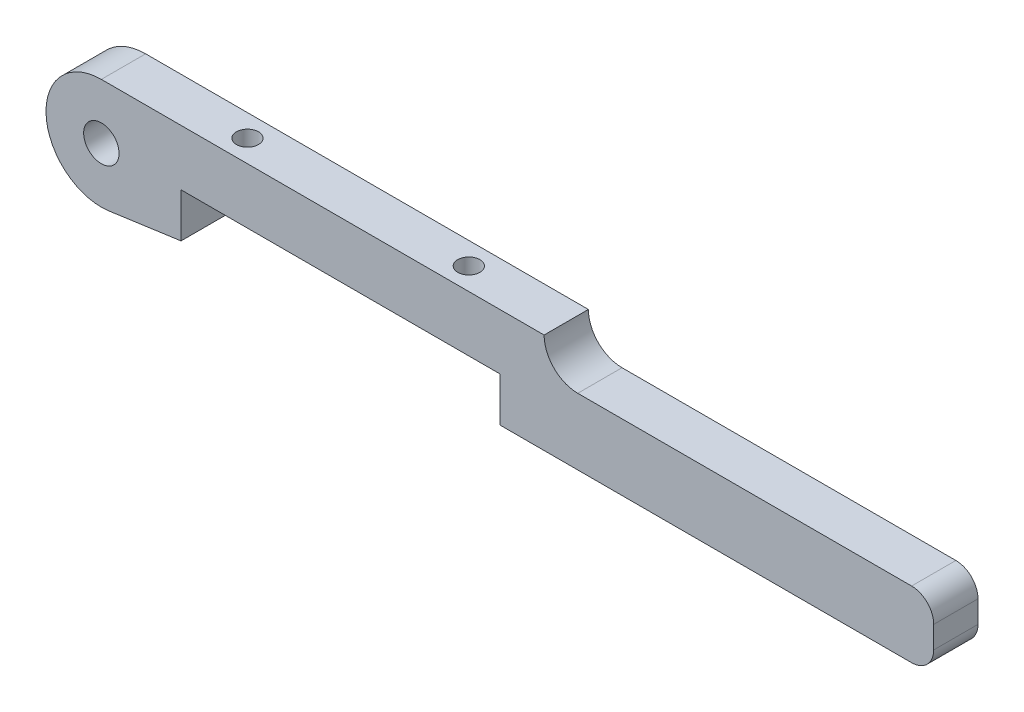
ISO-10303-21;
HEADER;
FILE_DESCRIPTION(('STEP AP214'),'2;1');
FILE_NAME('part.step','',(''),(''),'','','');
FILE_SCHEMA(('AUTOMOTIVE_DESIGN { 1 0 10303 214 1 1 1 1 }'));
ENDSEC;
DATA;
#1=APPLICATION_CONTEXT('core data for automotive mechanical design processes');
#2=APPLICATION_PROTOCOL_DEFINITION('international standard','automotive_design',2000,#1);
#3=PRODUCT_CONTEXT('',#1,'mechanical');
#4=PRODUCT('Part','Part','',(#3));
#5=PRODUCT_RELATED_PRODUCT_CATEGORY('part','',(#4));
#6=PRODUCT_DEFINITION_FORMATION('','',#4);
#7=PRODUCT_DEFINITION_CONTEXT('part definition',#1,'design');
#8=PRODUCT_DEFINITION('design','',#6,#7);
#9=PRODUCT_DEFINITION_SHAPE('','',#8);
#10=(LENGTH_UNIT() NAMED_UNIT(*) SI_UNIT(.MILLI.,.METRE.));
#11=(NAMED_UNIT(*) PLANE_ANGLE_UNIT() SI_UNIT($,.RADIAN.));
#12=(NAMED_UNIT(*) SI_UNIT($,.STERADIAN.) SOLID_ANGLE_UNIT());
#13=UNCERTAINTY_MEASURE_WITH_UNIT(LENGTH_MEASURE(1.E-05),#10,'distance_accuracy_value','');
#14=(GEOMETRIC_REPRESENTATION_CONTEXT(3) GLOBAL_UNCERTAINTY_ASSIGNED_CONTEXT((#13)) GLOBAL_UNIT_ASSIGNED_CONTEXT((#10,
#11,#12)) REPRESENTATION_CONTEXT('',''));
#15=CARTESIAN_POINT('',(0.,0.,0.));
#16=DIRECTION('',(0.,0.,1.));
#17=DIRECTION('',(1.,0.,0.));
#18=AXIS2_PLACEMENT_3D('',#15,#16,#17);
#19=CARTESIAN_POINT('',(232.41,-6.47699999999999,6.35));
#20=DIRECTION('',(0.,0.,-1.));
#21=DIRECTION('',(-1.,0.,0.));
#22=AXIS2_PLACEMENT_3D('',#19,#20,#21);
#23=PLANE('',#22);
#24=CARTESIAN_POINT('',(232.41,-6.47699999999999,6.35));
#25=DIRECTION('',(0.,0.,1.));
#26=DIRECTION('',(-1.,0.,0.));
#27=AXIS2_PLACEMENT_3D('',#24,#25,#26);
#28=CIRCLE('',#27,6.35);
#29=CARTESIAN_POINT('',(232.41,-12.827,6.35));
#30=VERTEX_POINT('',#29);
#31=CARTESIAN_POINT('',(238.76,-6.47699999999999,6.35));
#32=VERTEX_POINT('',#31);
#33=EDGE_CURVE('E192',#30,#32,#28,.T.);
#34=ORIENTED_EDGE('',*,*,#33,.T.);
#35=DIRECTION('',(0.,1.,0.));
#36=VECTOR('',#35,1.);
#37=CARTESIAN_POINT('',(238.76,-0.126999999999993,6.35));
#38=LINE('',#37,#36);
#39=CARTESIAN_POINT('',(238.76,-0.126999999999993,6.35));
#40=VERTEX_POINT('',#39);
#41=EDGE_CURVE('E120',#32,#40,#38,.T.);
#42=ORIENTED_EDGE('',*,*,#41,.T.);
#43=CARTESIAN_POINT('',(232.41,-0.126999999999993,6.35));
#44=DIRECTION('',(0.,0.,1.));
#45=DIRECTION('',(-1.,0.,0.));
#46=AXIS2_PLACEMENT_3D('',#43,#44,#45);
#47=CIRCLE('',#46,6.35);
#48=CARTESIAN_POINT('',(232.41,6.223,6.35));
#49=VERTEX_POINT('',#48);
#50=EDGE_CURVE('E235',#40,#49,#47,.T.);
#51=ORIENTED_EDGE('',*,*,#50,.T.);
#52=DIRECTION('',(-1.,0.,0.));
#53=VECTOR('',#52,1.);
#54=CARTESIAN_POINT('',(136.652,6.22300000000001,6.35));
#55=LINE('',#54,#53);
#56=CARTESIAN_POINT('',(136.652,6.22300000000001,6.35));
#57=VERTEX_POINT('',#56);
#58=EDGE_CURVE('E237',#49,#57,#55,.T.);
#59=ORIENTED_EDGE('',*,*,#58,.T.);
#60=CARTESIAN_POINT('',(136.652,15.875,6.35));
#61=DIRECTION('',(0.,0.,-1.));
#62=DIRECTION('',(1.,0.,0.));
#63=AXIS2_PLACEMENT_3D('',#60,#61,#62);
#64=CIRCLE('',#63,9.65199999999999);
#65=CARTESIAN_POINT('',(127.,15.875,6.35));
#66=VERTEX_POINT('',#65);
#67=EDGE_CURVE('E239',#57,#66,#64,.T.);
#68=ORIENTED_EDGE('',*,*,#67,.T.);
#69=DIRECTION('',(-1.,0.,0.));
#70=VECTOR('',#69,1.);
#71=CARTESIAN_POINT('',(0.,15.875,6.35));
#72=LINE('',#71,#70);
#73=CARTESIAN_POINT('',(0.,15.875,6.35));
#74=VERTEX_POINT('',#73);
#75=EDGE_CURVE('E241',#66,#74,#72,.T.);
#76=ORIENTED_EDGE('',*,*,#75,.T.);
#77=CARTESIAN_POINT('',(0.,0.,6.35));
#78=DIRECTION('',(0.,0.,1.));
#79=DIRECTION('',(1.,0.,0.));
#80=AXIS2_PLACEMENT_3D('',#77,#78,#79);
#81=CIRCLE('',#80,15.875);
#82=CARTESIAN_POINT('',(2.20284085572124,-15.7214222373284,6.35));
#83=VERTEX_POINT('',#82);
#84=EDGE_CURVE('E243',#74,#83,#81,.T.);
#85=ORIENTED_EDGE('',*,*,#84,.T.);
#86=DIRECTION('',(0.990325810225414,0.138761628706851,0.));
#87=VECTOR('',#86,1.);
#88=CARTESIAN_POINT('',(22.86,-12.827,6.35));
#89=LINE('',#88,#87);
#90=CARTESIAN_POINT('',(22.86,-12.827,6.35));
#91=VERTEX_POINT('',#90);
#92=EDGE_CURVE('E245',#83,#91,#89,.T.);
#93=ORIENTED_EDGE('',*,*,#92,.T.);
#94=DIRECTION('',(0.,1.,0.));
#95=VECTOR('',#94,1.);
#96=CARTESIAN_POINT('',(22.86,-0.12700000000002,6.35));
#97=LINE('',#96,#95);
#98=CARTESIAN_POINT('',(22.86,-0.12700000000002,6.35));
#99=VERTEX_POINT('',#98);
#100=EDGE_CURVE('E151',#91,#99,#97,.T.);
#101=ORIENTED_EDGE('',*,*,#100,.T.);
#102=DIRECTION('',(1.,0.,0.));
#103=VECTOR('',#102,1.);
#104=CARTESIAN_POINT('',(114.3,-0.127000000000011,6.35));
#105=LINE('',#104,#103);
#106=CARTESIAN_POINT('',(114.3,-0.127000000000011,6.35));
#107=VERTEX_POINT('',#106);
#108=EDGE_CURVE('E145',#99,#107,#105,.T.);
#109=ORIENTED_EDGE('',*,*,#108,.T.);
#110=DIRECTION('',(0.,-1.,0.));
#111=VECTOR('',#110,1.);
#112=CARTESIAN_POINT('',(114.3,-12.827,6.35));
#113=LINE('',#112,#111);
#114=CARTESIAN_POINT('',(114.3,-12.827,6.35));
#115=VERTEX_POINT('',#114);
#116=EDGE_CURVE('E149',#107,#115,#113,.T.);
#117=ORIENTED_EDGE('',*,*,#116,.T.);
#118=DIRECTION('',(1.,0.,0.));
#119=VECTOR('',#118,1.);
#120=CARTESIAN_POINT('',(232.41,-12.827,6.35));
#121=LINE('',#120,#119);
#122=EDGE_CURVE('E65',#115,#30,#121,.T.);
#123=ORIENTED_EDGE('',*,*,#122,.T.);
#124=EDGE_LOOP('',(#34,#42,#51,#59,#68,#76,#85,#93,#101,#109,#117,#123));
#125=FACE_BOUND('',#124,.T.);
#126=CARTESIAN_POINT('',(0.,0.,6.35));
#127=DIRECTION('',(0.,0.,1.));
#128=DIRECTION('',(1.,0.,0.));
#129=AXIS2_PLACEMENT_3D('',#126,#127,#128);
#130=CIRCLE('',#129,5.08);
#131=CARTESIAN_POINT('',(5.08,0.,6.35));
#132=VERTEX_POINT('',#131);
#133=EDGE_CURVE('E173',#132,#132,#130,.T.);
#134=ORIENTED_EDGE('',*,*,#133,.F.);
#135=EDGE_LOOP('',(#134));
#136=FACE_BOUND('',#135,.T.);
#137=ADVANCED_FACE('F46',(#125,#136),#23,.F.);
#138=CARTESIAN_POINT('',(232.41,-6.47699999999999,-6.35));
#139=DIRECTION('',(0.,0.,-1.));
#140=DIRECTION('',(-1.,0.,0.));
#141=AXIS2_PLACEMENT_3D('',#138,#139,#140);
#142=PLANE('',#141);
#143=CARTESIAN_POINT('',(232.41,-6.47699999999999,-6.35));
#144=DIRECTION('',(0.,0.,1.));
#145=DIRECTION('',(-1.,0.,0.));
#146=AXIS2_PLACEMENT_3D('',#143,#144,#145);
#147=CIRCLE('',#146,6.35);
#148=CARTESIAN_POINT('',(232.41,-12.827,-6.35));
#149=VERTEX_POINT('',#148);
#150=CARTESIAN_POINT('',(238.76,-6.47699999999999,-6.35));
#151=VERTEX_POINT('',#150);
#152=EDGE_CURVE('E169',#149,#151,#147,.T.);
#153=ORIENTED_EDGE('',*,*,#152,.F.);
#154=DIRECTION('',(1.,0.,0.));
#155=VECTOR('',#154,1.);
#156=CARTESIAN_POINT('',(232.41,-12.827,-6.35));
#157=LINE('',#156,#155);
#158=CARTESIAN_POINT('',(114.3,-12.827,-6.35));
#159=VERTEX_POINT('',#158);
#160=EDGE_CURVE('E112',#159,#149,#157,.T.);
#161=ORIENTED_EDGE('',*,*,#160,.F.);
#162=DIRECTION('',(0.,-1.,0.));
#163=VECTOR('',#162,1.);
#164=CARTESIAN_POINT('',(114.3,-12.827,-6.35));
#165=LINE('',#164,#163);
#166=CARTESIAN_POINT('',(114.3,-0.127000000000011,-6.35));
#167=VERTEX_POINT('',#166);
#168=EDGE_CURVE('E106',#167,#159,#165,.T.);
#169=ORIENTED_EDGE('',*,*,#168,.F.);
#170=DIRECTION('',(1.,0.,0.));
#171=VECTOR('',#170,1.);
#172=CARTESIAN_POINT('',(114.3,-0.127000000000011,-6.35));
#173=LINE('',#172,#171);
#174=CARTESIAN_POINT('',(22.86,-0.12700000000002,-6.35));
#175=VERTEX_POINT('',#174);
#176=EDGE_CURVE('E159',#175,#167,#173,.T.);
#177=ORIENTED_EDGE('',*,*,#176,.F.);
#178=DIRECTION('',(0.,1.,0.));
#179=VECTOR('',#178,1.);
#180=CARTESIAN_POINT('',(22.86,-0.12700000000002,-6.35));
#181=LINE('',#180,#179);
#182=CARTESIAN_POINT('',(22.86,-12.827,-6.35));
#183=VERTEX_POINT('',#182);
#184=EDGE_CURVE('E187',#183,#175,#181,.T.);
#185=ORIENTED_EDGE('',*,*,#184,.F.);
#186=DIRECTION('',(0.990325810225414,0.138761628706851,0.));
#187=VECTOR('',#186,1.);
#188=CARTESIAN_POINT('',(22.86,-12.827,-6.35));
#189=LINE('',#188,#187);
#190=CARTESIAN_POINT('',(2.20284085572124,-15.7214222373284,-6.35));
#191=VERTEX_POINT('',#190);
#192=EDGE_CURVE('E185',#191,#183,#189,.T.);
#193=ORIENTED_EDGE('',*,*,#192,.F.);
#194=CARTESIAN_POINT('',(0.,0.,-6.35));
#195=DIRECTION('',(0.,0.,1.));
#196=DIRECTION('',(1.,0.,0.));
#197=AXIS2_PLACEMENT_3D('',#194,#195,#196);
#198=CIRCLE('',#197,15.875);
#199=CARTESIAN_POINT('',(0.,15.875,-6.35));
#200=VERTEX_POINT('',#199);
#201=EDGE_CURVE('E183',#200,#191,#198,.T.);
#202=ORIENTED_EDGE('',*,*,#201,.F.);
#203=DIRECTION('',(-1.,0.,0.));
#204=VECTOR('',#203,1.);
#205=CARTESIAN_POINT('',(0.,15.875,-6.35));
#206=LINE('',#205,#204);
#207=CARTESIAN_POINT('',(127.,15.875,-6.35));
#208=VERTEX_POINT('',#207);
#209=EDGE_CURVE('E181',#208,#200,#206,.T.);
#210=ORIENTED_EDGE('',*,*,#209,.F.);
#211=CARTESIAN_POINT('',(136.652,15.875,-6.35));
#212=DIRECTION('',(0.,0.,-1.));
#213=DIRECTION('',(1.,0.,0.));
#214=AXIS2_PLACEMENT_3D('',#211,#212,#213);
#215=CIRCLE('',#214,9.65199999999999);
#216=CARTESIAN_POINT('',(136.652,6.22300000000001,-6.35));
#217=VERTEX_POINT('',#216);
#218=EDGE_CURVE('E179',#217,#208,#215,.T.);
#219=ORIENTED_EDGE('',*,*,#218,.F.);
#220=DIRECTION('',(-1.,0.,0.));
#221=VECTOR('',#220,1.);
#222=CARTESIAN_POINT('',(136.652,6.22300000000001,-6.35));
#223=LINE('',#222,#221);
#224=CARTESIAN_POINT('',(232.41,6.223,-6.35));
#225=VERTEX_POINT('',#224);
#226=EDGE_CURVE('E177',#225,#217,#223,.T.);
#227=ORIENTED_EDGE('',*,*,#226,.F.);
#228=CARTESIAN_POINT('',(232.41,-0.126999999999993,-6.35));
#229=DIRECTION('',(0.,0.,1.));
#230=DIRECTION('',(-1.,0.,0.));
#231=AXIS2_PLACEMENT_3D('',#228,#229,#230);
#232=CIRCLE('',#231,6.35);
#233=CARTESIAN_POINT('',(238.76,-0.126999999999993,-6.35));
#234=VERTEX_POINT('',#233);
#235=EDGE_CURVE('E175',#234,#225,#232,.T.);
#236=ORIENTED_EDGE('',*,*,#235,.F.);
#237=DIRECTION('',(0.,1.,0.));
#238=VECTOR('',#237,1.);
#239=CARTESIAN_POINT('',(238.76,-0.126999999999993,-6.35));
#240=LINE('',#239,#238);
#241=EDGE_CURVE('E172',#151,#234,#240,.T.);
#242=ORIENTED_EDGE('',*,*,#241,.F.);
#243=EDGE_LOOP('',(#153,#161,#169,#177,#185,#193,#202,#210,#219,#227,#236,#242));
#244=FACE_BOUND('',#243,.T.);
#245=CARTESIAN_POINT('',(0.,0.,-6.35));
#246=DIRECTION('',(0.,0.,1.));
#247=DIRECTION('',(1.,0.,0.));
#248=AXIS2_PLACEMENT_3D('',#245,#246,#247);
#249=CIRCLE('',#248,5.08);
#250=CARTESIAN_POINT('',(5.08,0.,-6.35));
#251=VERTEX_POINT('',#250);
#252=EDGE_CURVE('E217',#251,#251,#249,.T.);
#253=ORIENTED_EDGE('',*,*,#252,.T.);
#254=EDGE_LOOP('',(#253));
#255=FACE_BOUND('',#254,.T.);
#256=ADVANCED_FACE('F258',(#244,#255),#142,.T.);
#257=CARTESIAN_POINT('',(232.41,-6.47699999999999,6.35));
#258=DIRECTION('',(0.,0.,-1.));
#259=DIRECTION('',(-1.,0.,0.));
#260=AXIS2_PLACEMENT_3D('',#257,#258,#259);
#261=CYLINDRICAL_SURFACE('',#260,6.35);
#262=ORIENTED_EDGE('',*,*,#152,.T.);
#263=DIRECTION('',(0.,0.,-1.));
#264=VECTOR('',#263,1.);
#265=CARTESIAN_POINT('',(238.76,-6.47699999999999,6.35));
#266=LINE('',#265,#264);
#267=EDGE_CURVE('E13',#32,#151,#266,.T.);
#268=ORIENTED_EDGE('',*,*,#267,.F.);
#269=ORIENTED_EDGE('',*,*,#33,.F.);
#270=DIRECTION('',(0.,0.,-1.));
#271=VECTOR('',#270,1.);
#272=CARTESIAN_POINT('',(232.41,-12.827,6.35));
#273=LINE('',#272,#271);
#274=EDGE_CURVE('E165',#30,#149,#273,.T.);
#275=ORIENTED_EDGE('',*,*,#274,.T.);
#276=EDGE_LOOP('',(#262,#268,#269,#275));
#277=FACE_BOUND('',#276,.T.);
#278=ADVANCED_FACE('F48',(#277),#261,.T.);
#279=CARTESIAN_POINT('',(238.76,-0.126999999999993,6.35));
#280=DIRECTION('',(-1.,0.,0.));
#281=DIRECTION('',(0.,0.,1.));
#282=AXIS2_PLACEMENT_3D('',#279,#280,#281);
#283=PLANE('',#282);
#284=ORIENTED_EDGE('',*,*,#241,.T.);
#285=DIRECTION('',(0.,0.,-1.));
#286=VECTOR('',#285,1.);
#287=CARTESIAN_POINT('',(238.76,-0.126999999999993,6.35));
#288=LINE('',#287,#286);
#289=EDGE_CURVE('E56',#40,#234,#288,.T.);
#290=ORIENTED_EDGE('',*,*,#289,.F.);
#291=ORIENTED_EDGE('',*,*,#41,.F.);
#292=ORIENTED_EDGE('',*,*,#267,.T.);
#293=EDGE_LOOP('',(#284,#290,#291,#292));
#294=FACE_BOUND('',#293,.T.);
#295=ADVANCED_FACE('F322',(#294),#283,.F.);
#296=CARTESIAN_POINT('',(232.41,-0.126999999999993,6.35));
#297=DIRECTION('',(0.,0.,-1.));
#298=DIRECTION('',(-1.,0.,0.));
#299=AXIS2_PLACEMENT_3D('',#296,#297,#298);
#300=CYLINDRICAL_SURFACE('',#299,6.35);
#301=ORIENTED_EDGE('',*,*,#235,.T.);
#302=DIRECTION('',(0.,0.,-1.));
#303=VECTOR('',#302,1.);
#304=CARTESIAN_POINT('',(232.41,6.223,6.35));
#305=LINE('',#304,#303);
#306=EDGE_CURVE('E211',#49,#225,#305,.T.);
#307=ORIENTED_EDGE('',*,*,#306,.F.);
#308=ORIENTED_EDGE('',*,*,#50,.F.);
#309=ORIENTED_EDGE('',*,*,#289,.T.);
#310=EDGE_LOOP('',(#301,#307,#308,#309));
#311=FACE_BOUND('',#310,.T.);
#312=ADVANCED_FACE('F319',(#311),#300,.T.);
#313=CARTESIAN_POINT('',(136.652,6.22300000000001,6.35));
#314=DIRECTION('',(0.,-1.,0.));
#315=DIRECTION('',(0.,0.,-1.));
#316=AXIS2_PLACEMENT_3D('',#313,#314,#315);
#317=PLANE('',#316);
#318=ORIENTED_EDGE('',*,*,#226,.T.);
#319=DIRECTION('',(0.,0.,-1.));
#320=VECTOR('',#319,1.);
#321=CARTESIAN_POINT('',(136.652,6.22300000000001,6.35));
#322=LINE('',#321,#320);
#323=EDGE_CURVE('E208',#57,#217,#322,.T.);
#324=ORIENTED_EDGE('',*,*,#323,.F.);
#325=ORIENTED_EDGE('',*,*,#58,.F.);
#326=ORIENTED_EDGE('',*,*,#306,.T.);
#327=EDGE_LOOP('',(#318,#324,#325,#326));
#328=FACE_BOUND('',#327,.T.);
#329=ADVANCED_FACE('F315',(#328),#317,.F.);
#330=CARTESIAN_POINT('',(136.652,15.875,6.35));
#331=DIRECTION('',(0.,0.,-1.));
#332=DIRECTION('',(-1.,0.,0.));
#333=AXIS2_PLACEMENT_3D('',#330,#331,#332);
#334=CYLINDRICAL_SURFACE('',#333,9.65199999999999);
#335=ORIENTED_EDGE('',*,*,#218,.T.);
#336=DIRECTION('',(0.,0.,-1.));
#337=VECTOR('',#336,1.);
#338=CARTESIAN_POINT('',(127.,15.875,6.35));
#339=LINE('',#338,#337);
#340=EDGE_CURVE('E205',#66,#208,#339,.T.);
#341=ORIENTED_EDGE('',*,*,#340,.F.);
#342=ORIENTED_EDGE('',*,*,#67,.F.);
#343=ORIENTED_EDGE('',*,*,#323,.T.);
#344=EDGE_LOOP('',(#335,#341,#342,#343));
#345=FACE_BOUND('',#344,.T.);
#346=ADVANCED_FACE('F311',(#345),#334,.F.);
#347=CARTESIAN_POINT('',(0.,15.875,6.35));
#348=DIRECTION('',(0.,-1.,0.));
#349=DIRECTION('',(0.,0.,-1.));
#350=AXIS2_PLACEMENT_3D('',#347,#348,#349);
#351=PLANE('',#350);
#352=CARTESIAN_POINT('',(99.06,15.875,0.));
#353=DIRECTION('',(0.,1.,0.));
#354=DIRECTION('',(0.,0.,1.));
#355=AXIS2_PLACEMENT_3D('',#352,#353,#354);
#356=CIRCLE('',#355,3.175);
#357=CARTESIAN_POINT('',(99.06,15.875,3.175));
#358=VERTEX_POINT('',#357);
#359=EDGE_CURVE('E228',#358,#358,#356,.T.);
#360=ORIENTED_EDGE('',*,*,#359,.F.);
#361=EDGE_LOOP('',(#360));
#362=FACE_BOUND('',#361,.T.);
#363=CARTESIAN_POINT('',(35.56,15.875,0.));
#364=DIRECTION('',(0.,1.,0.));
#365=DIRECTION('',(0.,0.,1.));
#366=AXIS2_PLACEMENT_3D('',#363,#364,#365);
#367=CIRCLE('',#366,3.17500000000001);
#368=CARTESIAN_POINT('',(35.56,15.875,3.17500000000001));
#369=VERTEX_POINT('',#368);
#370=EDGE_CURVE('E218',#369,#369,#367,.T.);
#371=ORIENTED_EDGE('',*,*,#370,.F.);
#372=EDGE_LOOP('',(#371));
#373=FACE_BOUND('',#372,.T.);
#374=ORIENTED_EDGE('',*,*,#209,.T.);
#375=DIRECTION('',(0.,0.,-1.));
#376=VECTOR('',#375,1.);
#377=CARTESIAN_POINT('',(0.,15.875,6.35));
#378=LINE('',#377,#376);
#379=EDGE_CURVE('E202',#74,#200,#378,.T.);
#380=ORIENTED_EDGE('',*,*,#379,.F.);
#381=ORIENTED_EDGE('',*,*,#75,.F.);
#382=ORIENTED_EDGE('',*,*,#340,.T.);
#383=EDGE_LOOP('',(#374,#380,#381,#382));
#384=FACE_BOUND('',#383,.T.);
#385=ADVANCED_FACE('F307',(#362,#373,#384),#351,.F.);
#386=CARTESIAN_POINT('',(0.,0.,6.35));
#387=DIRECTION('',(0.,0.,-1.));
#388=DIRECTION('',(-1.,0.,0.));
#389=AXIS2_PLACEMENT_3D('',#386,#387,#388);
#390=CYLINDRICAL_SURFACE('',#389,15.875);
#391=ORIENTED_EDGE('',*,*,#201,.T.);
#392=DIRECTION('',(0.,0.,-1.));
#393=VECTOR('',#392,1.);
#394=CARTESIAN_POINT('',(2.20284085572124,-15.7214222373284,6.35));
#395=LINE('',#394,#393);
#396=EDGE_CURVE('E199',#83,#191,#395,.T.);
#397=ORIENTED_EDGE('',*,*,#396,.F.);
#398=ORIENTED_EDGE('',*,*,#84,.F.);
#399=ORIENTED_EDGE('',*,*,#379,.T.);
#400=EDGE_LOOP('',(#391,#397,#398,#399));
#401=FACE_BOUND('',#400,.T.);
#402=ADVANCED_FACE('F304',(#401),#390,.T.);
#403=CARTESIAN_POINT('',(22.86,-12.827,6.35));
#404=DIRECTION('',(-0.138761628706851,0.990325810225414,0.));
#405=DIRECTION('',(-0.990325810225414,-0.138761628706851,0.));
#406=AXIS2_PLACEMENT_3D('',#403,#404,#405);
#407=PLANE('',#406);
#408=ORIENTED_EDGE('',*,*,#192,.T.);
#409=DIRECTION('',(0.,0.,-1.));
#410=VECTOR('',#409,1.);
#411=CARTESIAN_POINT('',(22.86,-12.827,6.35));
#412=LINE('',#411,#410);
#413=EDGE_CURVE('E196',#91,#183,#412,.T.);
#414=ORIENTED_EDGE('',*,*,#413,.F.);
#415=ORIENTED_EDGE('',*,*,#92,.F.);
#416=ORIENTED_EDGE('',*,*,#396,.T.);
#417=EDGE_LOOP('',(#408,#414,#415,#416));
#418=FACE_BOUND('',#417,.T.);
#419=ADVANCED_FACE('F251',(#418),#407,.F.);
#420=CARTESIAN_POINT('',(22.86,-0.12700000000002,6.35));
#421=DIRECTION('',(-1.,0.,0.));
#422=DIRECTION('',(0.,-1.,0.));
#423=AXIS2_PLACEMENT_3D('',#420,#421,#422);
#424=PLANE('',#423);
#425=ORIENTED_EDGE('',*,*,#184,.T.);
#426=DIRECTION('',(0.,0.,-1.));
#427=VECTOR('',#426,1.);
#428=CARTESIAN_POINT('',(22.86,-0.12700000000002,6.35));
#429=LINE('',#428,#427);
#430=EDGE_CURVE('E160',#99,#175,#429,.T.);
#431=ORIENTED_EDGE('',*,*,#430,.F.);
#432=ORIENTED_EDGE('',*,*,#100,.F.);
#433=ORIENTED_EDGE('',*,*,#413,.T.);
#434=EDGE_LOOP('',(#425,#431,#432,#433));
#435=FACE_BOUND('',#434,.T.);
#436=ADVANCED_FACE('F255',(#435),#424,.F.);
#437=CARTESIAN_POINT('',(114.3,-0.127000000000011,6.35));
#438=DIRECTION('',(0.,1.,0.));
#439=DIRECTION('',(-1.,0.,0.));
#440=AXIS2_PLACEMENT_3D('',#437,#438,#439);
#441=PLANE('',#440);
#442=CARTESIAN_POINT('',(99.06,-0.127000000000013,0.));
#443=DIRECTION('',(0.,1.,0.));
#444=DIRECTION('',(-1.,0.,0.));
#445=AXIS2_PLACEMENT_3D('',#442,#443,#444);
#446=CIRCLE('',#445,3.175);
#447=CARTESIAN_POINT('',(95.885,-0.127000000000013,0.));
#448=VERTEX_POINT('',#447);
#449=EDGE_CURVE('E50',#448,#448,#446,.T.);
#450=ORIENTED_EDGE('',*,*,#449,.T.);
#451=EDGE_LOOP('',(#450));
#452=FACE_BOUND('',#451,.T.);
#453=CARTESIAN_POINT('',(35.56,-0.127000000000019,0.));
#454=DIRECTION('',(0.,1.,0.));
#455=DIRECTION('',(-1.,0.,0.));
#456=AXIS2_PLACEMENT_3D('',#453,#454,#455);
#457=CIRCLE('',#456,3.17500000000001);
#458=CARTESIAN_POINT('',(32.385,-0.12700000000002,0.));
#459=VERTEX_POINT('',#458);
#460=EDGE_CURVE('E215',#459,#459,#457,.T.);
#461=ORIENTED_EDGE('',*,*,#460,.T.);
#462=EDGE_LOOP('',(#461));
#463=FACE_BOUND('',#462,.T.);
#464=ORIENTED_EDGE('',*,*,#176,.T.);
#465=DIRECTION('',(0.,0.,-1.));
#466=VECTOR('',#465,1.);
#467=CARTESIAN_POINT('',(114.3,-0.127000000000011,6.35));
#468=LINE('',#467,#466);
#469=EDGE_CURVE('E156',#107,#167,#468,.T.);
#470=ORIENTED_EDGE('',*,*,#469,.F.);
#471=ORIENTED_EDGE('',*,*,#108,.F.);
#472=ORIENTED_EDGE('',*,*,#430,.T.);
#473=EDGE_LOOP('',(#464,#470,#471,#472));
#474=FACE_BOUND('',#473,.T.);
#475=ADVANCED_FACE('F157',(#452,#463,#474),#441,.F.);
#476=CARTESIAN_POINT('',(114.3,-12.827,6.35));
#477=DIRECTION('',(1.,0.,0.));
#478=DIRECTION('',(0.,0.,-1.));
#479=AXIS2_PLACEMENT_3D('',#476,#477,#478);
#480=PLANE('',#479);
#481=ORIENTED_EDGE('',*,*,#168,.T.);
#482=DIRECTION('',(0.,0.,-1.));
#483=VECTOR('',#482,1.);
#484=CARTESIAN_POINT('',(114.3,-12.827,6.35));
#485=LINE('',#484,#483);
#486=EDGE_CURVE('E161',#115,#159,#485,.T.);
#487=ORIENTED_EDGE('',*,*,#486,.F.);
#488=ORIENTED_EDGE('',*,*,#116,.F.);
#489=ORIENTED_EDGE('',*,*,#469,.T.);
#490=EDGE_LOOP('',(#481,#487,#488,#489));
#491=FACE_BOUND('',#490,.T.);
#492=ADVANCED_FACE('F163',(#491),#480,.F.);
#493=CARTESIAN_POINT('',(232.41,-12.827,6.35));
#494=DIRECTION('',(0.,1.,0.));
#495=DIRECTION('',(-1.,0.,0.));
#496=AXIS2_PLACEMENT_3D('',#493,#494,#495);
#497=PLANE('',#496);
#498=ORIENTED_EDGE('',*,*,#160,.T.);
#499=ORIENTED_EDGE('',*,*,#274,.F.);
#500=ORIENTED_EDGE('',*,*,#122,.F.);
#501=ORIENTED_EDGE('',*,*,#486,.T.);
#502=EDGE_LOOP('',(#498,#499,#500,#501));
#503=FACE_BOUND('',#502,.T.);
#504=ADVANCED_FACE('F264',(#503),#497,.F.);
#505=CARTESIAN_POINT('',(0.,0.,6.35));
#506=DIRECTION('',(0.,0.,-1.));
#507=DIRECTION('',(-1.,0.,0.));
#508=AXIS2_PLACEMENT_3D('',#505,#506,#507);
#509=CYLINDRICAL_SURFACE('',#508,5.08);
#510=ORIENTED_EDGE('',*,*,#133,.T.);
#511=EDGE_LOOP('',(#510));
#512=FACE_BOUND('',#511,.T.);
#513=ORIENTED_EDGE('',*,*,#252,.F.);
#514=EDGE_LOOP('',(#513));
#515=FACE_BOUND('',#514,.T.);
#516=ADVANCED_FACE('F266',(#512,#515),#509,.F.);
#517=CARTESIAN_POINT('',(35.56,-14.097,0.));
#518=DIRECTION('',(0.,1.,0.));
#519=DIRECTION('',(0.,0.,1.));
#520=AXIS2_PLACEMENT_3D('',#517,#518,#519);
#521=CYLINDRICAL_SURFACE('',#520,3.17500000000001);
#522=ORIENTED_EDGE('',*,*,#370,.T.);
#523=EDGE_LOOP('',(#522));
#524=FACE_BOUND('',#523,.T.);
#525=ORIENTED_EDGE('',*,*,#460,.F.);
#526=EDGE_LOOP('',(#525));
#527=FACE_BOUND('',#526,.T.);
#528=ADVANCED_FACE('F272',(#524,#527),#521,.F.);
#529=CARTESIAN_POINT('',(99.06,-14.097,0.));
#530=DIRECTION('',(0.,1.,0.));
#531=DIRECTION('',(0.,0.,1.));
#532=AXIS2_PLACEMENT_3D('',#529,#530,#531);
#533=CYLINDRICAL_SURFACE('',#532,3.175);
#534=ORIENTED_EDGE('',*,*,#359,.T.);
#535=EDGE_LOOP('',(#534));
#536=FACE_BOUND('',#535,.T.);
#537=ORIENTED_EDGE('',*,*,#449,.F.);
#538=EDGE_LOOP('',(#537));
#539=FACE_BOUND('',#538,.T.);
#540=ADVANCED_FACE('F285',(#536,#539),#533,.F.);
#541=CLOSED_SHELL('',(#137,#256,#278,#295,#312,#329,#346,#385,#402,#419,#436,#475,#492,#504,
#516,#528,#540));
#542=MANIFOLD_SOLID_BREP('B2',#541);
#543=ADVANCED_BREP_SHAPE_REPRESENTATION('',(#18,#542),#14);
#544=SHAPE_DEFINITION_REPRESENTATION(#9,#543);
ENDSEC;
END-ISO-10303-21;
